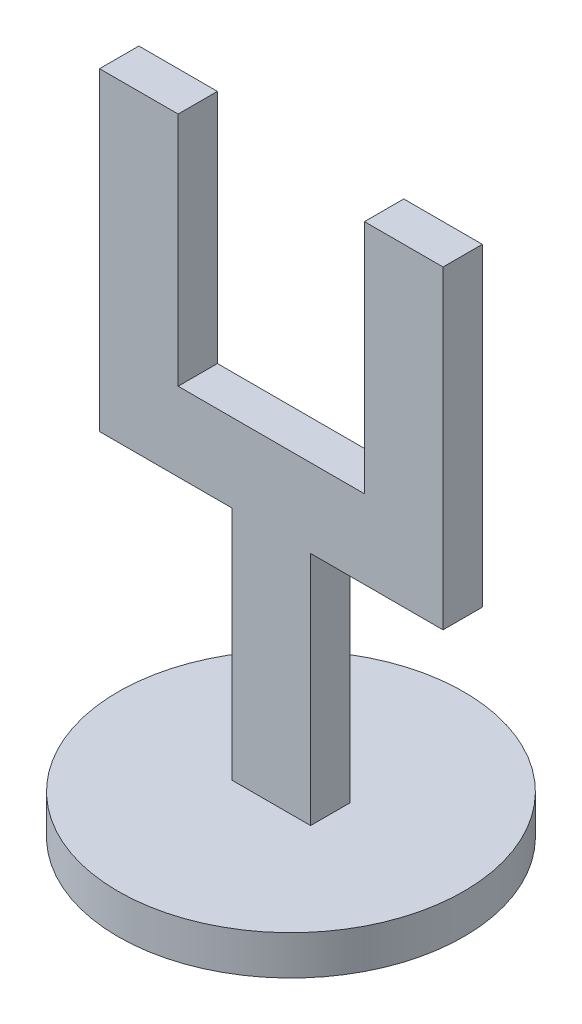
ISO-10303-21;
HEADER;
FILE_DESCRIPTION(('STEP AP214'),'2;1');
FILE_NAME('part.step','',(''),(''),'','','');
FILE_SCHEMA(('AUTOMOTIVE_DESIGN { 1 0 10303 214 1 1 1 1 }'));
ENDSEC;
DATA;
#1=APPLICATION_CONTEXT('core data for automotive mechanical design processes');
#2=APPLICATION_PROTOCOL_DEFINITION('international standard','automotive_design',2000,#1);
#3=PRODUCT_CONTEXT('',#1,'mechanical');
#4=PRODUCT('Part','Part','',(#3));
#5=PRODUCT_RELATED_PRODUCT_CATEGORY('part','',(#4));
#6=PRODUCT_DEFINITION_FORMATION('','',#4);
#7=PRODUCT_DEFINITION_CONTEXT('part definition',#1,'design');
#8=PRODUCT_DEFINITION('design','',#6,#7);
#9=PRODUCT_DEFINITION_SHAPE('','',#8);
#10=(LENGTH_UNIT() NAMED_UNIT(*) SI_UNIT(.MILLI.,.METRE.));
#11=(NAMED_UNIT(*) PLANE_ANGLE_UNIT() SI_UNIT($,.RADIAN.));
#12=(NAMED_UNIT(*) SI_UNIT($,.STERADIAN.) SOLID_ANGLE_UNIT());
#13=UNCERTAINTY_MEASURE_WITH_UNIT(LENGTH_MEASURE(1.E-05),#10,'distance_accuracy_value','');
#14=(GEOMETRIC_REPRESENTATION_CONTEXT(3) GLOBAL_UNCERTAINTY_ASSIGNED_CONTEXT((#13)) GLOBAL_UNIT_ASSIGNED_CONTEXT((#10,
#11,#12)) REPRESENTATION_CONTEXT('',''));
#15=CARTESIAN_POINT('',(0.,0.,0.));
#16=DIRECTION('',(0.,0.,1.));
#17=DIRECTION('',(1.,0.,0.));
#18=AXIS2_PLACEMENT_3D('',#15,#16,#17);
#19=CARTESIAN_POINT('',(0.,5.,0.));
#20=DIRECTION('',(0.,1.,0.));
#21=DIRECTION('',(0.,0.,1.));
#22=AXIS2_PLACEMENT_3D('',#19,#20,#21);
#23=PLANE('',#22);
#24=CARTESIAN_POINT('',(0.,5.,0.));
#25=DIRECTION('',(0.,1.,0.));
#26=DIRECTION('',(0.,0.,1.));
#27=AXIS2_PLACEMENT_3D('',#24,#25,#26);
#28=CIRCLE('',#27,22.);
#29=CARTESIAN_POINT('',(0.,5.,22.));
#30=VERTEX_POINT('',#29);
#31=EDGE_CURVE('E11',#30,#30,#28,.T.);
#32=ORIENTED_EDGE('',*,*,#31,.T.);
#33=EDGE_LOOP('',(#32));
#34=FACE_BOUND('',#33,.T.);
#35=DIRECTION('',(-1.,0.,0.));
#36=VECTOR('',#35,1.);
#37=CARTESIAN_POINT('',(-5.,5.,-2.5));
#38=LINE('',#37,#36);
#39=CARTESIAN_POINT('',(5.,5.,-2.5));
#40=VERTEX_POINT('',#39);
#41=CARTESIAN_POINT('',(-5.,5.,-2.5));
#42=VERTEX_POINT('',#41);
#43=EDGE_CURVE('E246',#40,#42,#38,.T.);
#44=ORIENTED_EDGE('',*,*,#43,.F.);
#45=DIRECTION('',(0.,0.,-1.));
#46=VECTOR('',#45,1.);
#47=CARTESIAN_POINT('',(5.,5.,-2.5));
#48=LINE('',#47,#46);
#49=CARTESIAN_POINT('',(5.,5.,2.5));
#50=VERTEX_POINT('',#49);
#51=EDGE_CURVE('E232',#50,#40,#48,.T.);
#52=ORIENTED_EDGE('',*,*,#51,.F.);
#53=DIRECTION('',(1.,0.,0.));
#54=VECTOR('',#53,1.);
#55=CARTESIAN_POINT('',(-5.,5.,2.5));
#56=LINE('',#55,#54);
#57=CARTESIAN_POINT('',(-5.,5.,2.5));
#58=VERTEX_POINT('',#57);
#59=EDGE_CURVE('E238',#58,#50,#56,.T.);
#60=ORIENTED_EDGE('',*,*,#59,.F.);
#61=DIRECTION('',(0.,0.,1.));
#62=VECTOR('',#61,1.);
#63=CARTESIAN_POINT('',(-5.,5.,-2.5));
#64=LINE('',#63,#62);
#65=EDGE_CURVE('E249',#42,#58,#64,.T.);
#66=ORIENTED_EDGE('',*,*,#65,.F.);
#67=EDGE_LOOP('',(#44,#52,#60,#66));
#68=FACE_BOUND('',#67,.T.);
#69=ADVANCED_FACE('F45',(#34,#68),#23,.T.);
#70=CARTESIAN_POINT('',(0.,5.,0.));
#71=DIRECTION('',(0.,-1.,0.));
#72=DIRECTION('',(0.,0.,-1.));
#73=AXIS2_PLACEMENT_3D('',#70,#71,#72);
#74=CYLINDRICAL_SURFACE('',#73,22.);
#75=ORIENTED_EDGE('',*,*,#31,.F.);
#76=EDGE_LOOP('',(#75));
#77=FACE_BOUND('',#76,.T.);
#78=CARTESIAN_POINT('',(0.,0.,0.));
#79=DIRECTION('',(0.,1.,0.));
#80=DIRECTION('',(0.,0.,1.));
#81=AXIS2_PLACEMENT_3D('',#78,#79,#80);
#82=CIRCLE('',#81,22.);
#83=CARTESIAN_POINT('',(0.,0.,22.));
#84=VERTEX_POINT('',#83);
#85=EDGE_CURVE('E49',#84,#84,#82,.T.);
#86=ORIENTED_EDGE('',*,*,#85,.T.);
#87=EDGE_LOOP('',(#86));
#88=FACE_BOUND('',#87,.T.);
#89=ADVANCED_FACE('F47',(#77,#88),#74,.T.);
#90=CARTESIAN_POINT('',(0.,0.,0.));
#91=DIRECTION('',(0.,1.,0.));
#92=DIRECTION('',(0.,0.,1.));
#93=AXIS2_PLACEMENT_3D('',#90,#91,#92);
#94=PLANE('',#93);
#95=CARTESIAN_POINT('',(0.,0.,0.));
#96=DIRECTION('',(0.,-1.,0.));
#97=DIRECTION('',(0.,0.,-1.));
#98=AXIS2_PLACEMENT_3D('',#95,#96,#97);
#99=CIRCLE('',#98,20.5);
#100=CARTESIAN_POINT('',(0.,0.,-20.5));
#101=VERTEX_POINT('',#100);
#102=EDGE_CURVE('E268',#101,#101,#99,.T.);
#103=ORIENTED_EDGE('',*,*,#102,.F.);
#104=EDGE_LOOP('',(#103));
#105=FACE_BOUND('',#104,.T.);
#106=ORIENTED_EDGE('',*,*,#85,.F.);
#107=EDGE_LOOP('',(#106));
#108=FACE_BOUND('',#107,.T.);
#109=ADVANCED_FACE('F279',(#105,#108),#94,.F.);
#110=CARTESIAN_POINT('',(0.,2.5,0.));
#111=DIRECTION('',(0.,-1.,0.));
#112=DIRECTION('',(0.,0.,-1.));
#113=AXIS2_PLACEMENT_3D('',#110,#111,#112);
#114=CYLINDRICAL_SURFACE('',#113,20.5);
#115=CARTESIAN_POINT('',(0.,2.5,0.));
#116=DIRECTION('',(0.,-1.,0.));
#117=DIRECTION('',(0.,0.,-1.));
#118=AXIS2_PLACEMENT_3D('',#115,#116,#117);
#119=CIRCLE('',#118,20.5);
#120=CARTESIAN_POINT('',(0.,2.5,-20.5));
#121=VERTEX_POINT('',#120);
#122=EDGE_CURVE('E269',#121,#121,#119,.T.);
#123=ORIENTED_EDGE('',*,*,#122,.F.);
#124=EDGE_LOOP('',(#123));
#125=FACE_BOUND('',#124,.T.);
#126=ORIENTED_EDGE('',*,*,#102,.T.);
#127=EDGE_LOOP('',(#126));
#128=FACE_BOUND('',#127,.T.);
#129=ADVANCED_FACE('F277',(#125,#128),#114,.F.);
#130=CARTESIAN_POINT('',(0.,2.5,0.));
#131=DIRECTION('',(0.,-1.,0.));
#132=DIRECTION('',(0.,0.,-1.));
#133=AXIS2_PLACEMENT_3D('',#130,#131,#132);
#134=PLANE('',#133);
#135=ORIENTED_EDGE('',*,*,#122,.T.);
#136=EDGE_LOOP('',(#135));
#137=FACE_BOUND('',#136,.T.);
#138=ADVANCED_FACE('F317',(#137),#134,.T.);
#139=CARTESIAN_POINT('',(5.,35.,-2.5));
#140=DIRECTION('',(-1.,0.,0.));
#141=DIRECTION('',(0.,0.,1.));
#142=AXIS2_PLACEMENT_3D('',#139,#140,#141);
#143=PLANE('',#142);
#144=ORIENTED_EDGE('',*,*,#51,.T.);
#145=DIRECTION('',(0.,-1.,0.));
#146=VECTOR('',#145,1.);
#147=CARTESIAN_POINT('',(5.,35.,-2.5));
#148=LINE('',#147,#146);
#149=CARTESIAN_POINT('',(5.,35.,-2.5));
#150=VERTEX_POINT('',#149);
#151=EDGE_CURVE('E265',#150,#40,#148,.T.);
#152=ORIENTED_EDGE('',*,*,#151,.F.);
#153=DIRECTION('',(0.,0.,-1.));
#154=VECTOR('',#153,1.);
#155=CARTESIAN_POINT('',(5.,35.,-2.5));
#156=LINE('',#155,#154);
#157=CARTESIAN_POINT('',(5.,35.,2.5));
#158=VERTEX_POINT('',#157);
#159=EDGE_CURVE('E233',#158,#150,#156,.T.);
#160=ORIENTED_EDGE('',*,*,#159,.F.);
#161=DIRECTION('',(0.,-1.,0.));
#162=VECTOR('',#161,1.);
#163=CARTESIAN_POINT('',(5.,35.,2.5));
#164=LINE('',#163,#162);
#165=EDGE_CURVE('E242',#158,#50,#164,.T.);
#166=ORIENTED_EDGE('',*,*,#165,.T.);
#167=EDGE_LOOP('',(#144,#152,#160,#166));
#168=FACE_BOUND('',#167,.T.);
#169=ADVANCED_FACE('F315',(#168),#143,.F.);
#170=CARTESIAN_POINT('',(-5.,35.,-2.5));
#171=DIRECTION('',(0.,0.,1.));
#172=DIRECTION('',(1.,0.,0.));
#173=AXIS2_PLACEMENT_3D('',#170,#171,#172);
#174=PLANE('',#173);
#175=ORIENTED_EDGE('',*,*,#43,.T.);
#176=DIRECTION('',(0.,-1.,0.));
#177=VECTOR('',#176,1.);
#178=CARTESIAN_POINT('',(-5.,35.,-2.5));
#179=LINE('',#178,#177);
#180=CARTESIAN_POINT('',(-5.,35.,-2.5));
#181=VERTEX_POINT('',#180);
#182=EDGE_CURVE('E261',#181,#42,#179,.T.);
#183=ORIENTED_EDGE('',*,*,#182,.F.);
#184=DIRECTION('',(-1.,0.,0.));
#185=VECTOR('',#184,1.);
#186=CARTESIAN_POINT('',(21.8574929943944,35.,-2.5));
#187=LINE('',#186,#185);
#188=CARTESIAN_POINT('',(-21.8574929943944,35.,-2.5));
#189=VERTEX_POINT('',#188);
#190=EDGE_CURVE('E220',#181,#189,#187,.T.);
#191=ORIENTED_EDGE('',*,*,#190,.T.);
#192=DIRECTION('',(0.,-1.,0.));
#193=VECTOR('',#192,1.);
#194=CARTESIAN_POINT('',(-21.8574929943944,45.,-2.5));
#195=LINE('',#194,#193);
#196=CARTESIAN_POINT('',(-21.8574929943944,75.,-2.5));
#197=VERTEX_POINT('',#196);
#198=EDGE_CURVE('E147',#197,#189,#195,.T.);
#199=ORIENTED_EDGE('',*,*,#198,.F.);
#200=DIRECTION('',(-1.,0.,0.));
#201=VECTOR('',#200,1.);
#202=CARTESIAN_POINT('',(-21.8574929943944,75.,-2.5));
#203=LINE('',#202,#201);
#204=CARTESIAN_POINT('',(-11.8574929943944,75.,-2.49999999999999));
#205=VERTEX_POINT('',#204);
#206=EDGE_CURVE('E187',#205,#197,#203,.T.);
#207=ORIENTED_EDGE('',*,*,#206,.F.);
#208=DIRECTION('',(0.,-1.,0.));
#209=VECTOR('',#208,1.);
#210=CARTESIAN_POINT('',(-11.8574929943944,75.,-2.49999999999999));
#211=LINE('',#210,#209);
#212=CARTESIAN_POINT('',(-11.8574929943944,45.,-2.49999999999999));
#213=VERTEX_POINT('',#212);
#214=EDGE_CURVE('E183',#205,#213,#211,.T.);
#215=ORIENTED_EDGE('',*,*,#214,.T.);
#216=DIRECTION('',(-1.,0.,0.));
#217=VECTOR('',#216,1.);
#218=CARTESIAN_POINT('',(21.8574929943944,45.,-2.5));
#219=LINE('',#218,#217);
#220=CARTESIAN_POINT('',(11.8574929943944,45.,-2.5));
#221=VERTEX_POINT('',#220);
#222=EDGE_CURVE('E206',#221,#213,#219,.T.);
#223=ORIENTED_EDGE('',*,*,#222,.F.);
#224=DIRECTION('',(0.,-1.,0.));
#225=VECTOR('',#224,1.);
#226=CARTESIAN_POINT('',(11.8574929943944,75.,-2.5));
#227=LINE('',#226,#225);
#228=CARTESIAN_POINT('',(11.8574929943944,75.,-2.5));
#229=VERTEX_POINT('',#228);
#230=EDGE_CURVE('E153',#229,#221,#227,.T.);
#231=ORIENTED_EDGE('',*,*,#230,.F.);
#232=DIRECTION('',(-1.,0.,0.));
#233=VECTOR('',#232,1.);
#234=CARTESIAN_POINT('',(21.8574929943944,75.,-2.5));
#235=LINE('',#234,#233);
#236=CARTESIAN_POINT('',(21.8574929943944,75.,-2.5));
#237=VERTEX_POINT('',#236);
#238=EDGE_CURVE('E150',#237,#229,#235,.T.);
#239=ORIENTED_EDGE('',*,*,#238,.F.);
#240=DIRECTION('',(0.,-1.,0.));
#241=VECTOR('',#240,1.);
#242=CARTESIAN_POINT('',(21.8574929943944,45.,-2.5));
#243=LINE('',#242,#241);
#244=CARTESIAN_POINT('',(21.8574929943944,35.,-2.5));
#245=VERTEX_POINT('',#244);
#246=EDGE_CURVE('E134',#237,#245,#243,.T.);
#247=ORIENTED_EDGE('',*,*,#246,.T.);
#248=EDGE_CURVE('E207',#245,#150,#187,.T.);
#249=ORIENTED_EDGE('',*,*,#248,.T.);
#250=ORIENTED_EDGE('',*,*,#151,.T.);
#251=EDGE_LOOP('',(#175,#183,#191,#199,#207,#215,#223,#231,#239,#247,#249,#250));
#252=FACE_BOUND('',#251,.T.);
#253=ADVANCED_FACE('F151',(#252),#174,.F.);
#254=CARTESIAN_POINT('',(-5.,35.,-2.5));
#255=DIRECTION('',(1.,0.,0.));
#256=DIRECTION('',(0.,0.,-1.));
#257=AXIS2_PLACEMENT_3D('',#254,#255,#256);
#258=PLANE('',#257);
#259=ORIENTED_EDGE('',*,*,#65,.T.);
#260=DIRECTION('',(0.,-1.,0.));
#261=VECTOR('',#260,1.);
#262=CARTESIAN_POINT('',(-5.,35.,2.5));
#263=LINE('',#262,#261);
#264=CARTESIAN_POINT('',(-5.,35.,2.5));
#265=VERTEX_POINT('',#264);
#266=EDGE_CURVE('E258',#265,#58,#263,.T.);
#267=ORIENTED_EDGE('',*,*,#266,.F.);
#268=DIRECTION('',(0.,0.,1.));
#269=VECTOR('',#268,1.);
#270=CARTESIAN_POINT('',(-5.,35.,-2.5));
#271=LINE('',#270,#269);
#272=EDGE_CURVE('E237',#181,#265,#271,.T.);
#273=ORIENTED_EDGE('',*,*,#272,.F.);
#274=ORIENTED_EDGE('',*,*,#182,.T.);
#275=EDGE_LOOP('',(#259,#267,#273,#274));
#276=FACE_BOUND('',#275,.T.);
#277=ADVANCED_FACE('F301',(#276),#258,.F.);
#278=CARTESIAN_POINT('',(-5.,35.,2.5));
#279=DIRECTION('',(0.,0.,-1.));
#280=DIRECTION('',(-1.,0.,0.));
#281=AXIS2_PLACEMENT_3D('',#278,#279,#280);
#282=PLANE('',#281);
#283=ORIENTED_EDGE('',*,*,#59,.T.);
#284=ORIENTED_EDGE('',*,*,#165,.F.);
#285=DIRECTION('',(1.,0.,0.));
#286=VECTOR('',#285,1.);
#287=CARTESIAN_POINT('',(21.8574929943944,35.,2.5));
#288=LINE('',#287,#286);
#289=CARTESIAN_POINT('',(21.8574929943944,35.,2.5));
#290=VERTEX_POINT('',#289);
#291=EDGE_CURVE('E213',#158,#290,#288,.T.);
#292=ORIENTED_EDGE('',*,*,#291,.T.);
#293=DIRECTION('',(0.,-1.,0.));
#294=VECTOR('',#293,1.);
#295=CARTESIAN_POINT('',(21.8574929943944,45.,2.5));
#296=LINE('',#295,#294);
#297=CARTESIAN_POINT('',(21.8574929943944,75.,2.5));
#298=VERTEX_POINT('',#297);
#299=EDGE_CURVE('E146',#298,#290,#296,.T.);
#300=ORIENTED_EDGE('',*,*,#299,.F.);
#301=DIRECTION('',(1.,0.,0.));
#302=VECTOR('',#301,1.);
#303=CARTESIAN_POINT('',(21.8574929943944,75.,2.5));
#304=LINE('',#303,#302);
#305=CARTESIAN_POINT('',(11.8574929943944,75.,2.5));
#306=VERTEX_POINT('',#305);
#307=EDGE_CURVE('E162',#306,#298,#304,.T.);
#308=ORIENTED_EDGE('',*,*,#307,.F.);
#309=DIRECTION('',(0.,-1.,0.));
#310=VECTOR('',#309,1.);
#311=CARTESIAN_POINT('',(11.8574929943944,75.,2.5));
#312=LINE('',#311,#310);
#313=CARTESIAN_POINT('',(11.8574929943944,45.,2.5));
#314=VERTEX_POINT('',#313);
#315=EDGE_CURVE('E171',#306,#314,#312,.T.);
#316=ORIENTED_EDGE('',*,*,#315,.T.);
#317=DIRECTION('',(1.,0.,0.));
#318=VECTOR('',#317,1.);
#319=CARTESIAN_POINT('',(21.8574929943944,45.,2.5));
#320=LINE('',#319,#318);
#321=CARTESIAN_POINT('',(-11.8574929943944,45.,2.5));
#322=VERTEX_POINT('',#321);
#323=EDGE_CURVE('E203',#322,#314,#320,.T.);
#324=ORIENTED_EDGE('',*,*,#323,.F.);
#325=DIRECTION('',(0.,-1.,0.));
#326=VECTOR('',#325,1.);
#327=CARTESIAN_POINT('',(-11.8574929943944,75.,2.5));
#328=LINE('',#327,#326);
#329=CARTESIAN_POINT('',(-11.8574929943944,75.,2.5));
#330=VERTEX_POINT('',#329);
#331=EDGE_CURVE('E179',#330,#322,#328,.T.);
#332=ORIENTED_EDGE('',*,*,#331,.F.);
#333=DIRECTION('',(1.,0.,0.));
#334=VECTOR('',#333,1.);
#335=CARTESIAN_POINT('',(-21.8574929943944,75.,2.5));
#336=LINE('',#335,#334);
#337=CARTESIAN_POINT('',(-21.8574929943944,75.,2.5));
#338=VERTEX_POINT('',#337);
#339=EDGE_CURVE('E197',#338,#330,#336,.T.);
#340=ORIENTED_EDGE('',*,*,#339,.F.);
#341=DIRECTION('',(0.,-1.,0.));
#342=VECTOR('',#341,1.);
#343=CARTESIAN_POINT('',(-21.8574929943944,45.,2.5));
#344=LINE('',#343,#342);
#345=CARTESIAN_POINT('',(-21.8574929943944,35.,2.5));
#346=VERTEX_POINT('',#345);
#347=EDGE_CURVE('E228',#338,#346,#344,.T.);
#348=ORIENTED_EDGE('',*,*,#347,.T.);
#349=EDGE_CURVE('E214',#346,#265,#288,.T.);
#350=ORIENTED_EDGE('',*,*,#349,.T.);
#351=ORIENTED_EDGE('',*,*,#266,.T.);
#352=EDGE_LOOP('',(#283,#284,#292,#300,#308,#316,#324,#332,#340,#348,#350,#351));
#353=FACE_BOUND('',#352,.T.);
#354=ADVANCED_FACE('F310',(#353),#282,.F.);
#355=CARTESIAN_POINT('',(0.,35.,0.));
#356=DIRECTION('',(0.,1.,0.));
#357=DIRECTION('',(0.,0.,1.));
#358=AXIS2_PLACEMENT_3D('',#355,#356,#357);
#359=PLANE('',#358);
#360=ORIENTED_EDGE('',*,*,#291,.F.);
#361=ORIENTED_EDGE('',*,*,#159,.T.);
#362=ORIENTED_EDGE('',*,*,#248,.F.);
#363=DIRECTION('',(0.,0.,-1.));
#364=VECTOR('',#363,1.);
#365=CARTESIAN_POINT('',(21.8574929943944,35.,2.5));
#366=LINE('',#365,#364);
#367=EDGE_CURVE('E141',#290,#245,#366,.T.);
#368=ORIENTED_EDGE('',*,*,#367,.F.);
#369=EDGE_LOOP('',(#360,#361,#362,#368));
#370=FACE_BOUND('',#369,.T.);
#371=ADVANCED_FACE('F313',(#370),#359,.F.);
#372=ORIENTED_EDGE('',*,*,#190,.F.);
#373=ORIENTED_EDGE('',*,*,#272,.T.);
#374=ORIENTED_EDGE('',*,*,#349,.F.);
#375=DIRECTION('',(0.,0.,1.));
#376=VECTOR('',#375,1.);
#377=CARTESIAN_POINT('',(-21.8574929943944,35.,2.5));
#378=LINE('',#377,#376);
#379=EDGE_CURVE('E178',#189,#346,#378,.T.);
#380=ORIENTED_EDGE('',*,*,#379,.F.);
#381=EDGE_LOOP('',(#372,#373,#374,#380));
#382=FACE_BOUND('',#381,.T.);
#383=ADVANCED_FACE('F305',(#382),#359,.F.);
#384=CARTESIAN_POINT('',(-21.8574929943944,45.,2.5));
#385=DIRECTION('',(1.,0.,0.));
#386=DIRECTION('',(0.,0.,-1.));
#387=AXIS2_PLACEMENT_3D('',#384,#385,#386);
#388=PLANE('',#387);
#389=ORIENTED_EDGE('',*,*,#379,.T.);
#390=ORIENTED_EDGE('',*,*,#347,.F.);
#391=DIRECTION('',(0.,0.,1.));
#392=VECTOR('',#391,1.);
#393=CARTESIAN_POINT('',(-21.8574929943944,75.,-2.5));
#394=LINE('',#393,#392);
#395=EDGE_CURVE('E190',#197,#338,#394,.T.);
#396=ORIENTED_EDGE('',*,*,#395,.F.);
#397=ORIENTED_EDGE('',*,*,#198,.T.);
#398=EDGE_LOOP('',(#389,#390,#396,#397));
#399=FACE_BOUND('',#398,.T.);
#400=ADVANCED_FACE('F386',(#399),#388,.F.);
#401=CARTESIAN_POINT('',(21.8574929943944,45.,2.5));
#402=DIRECTION('',(-1.,0.,0.));
#403=DIRECTION('',(0.,0.,1.));
#404=AXIS2_PLACEMENT_3D('',#401,#402,#403);
#405=PLANE('',#404);
#406=ORIENTED_EDGE('',*,*,#367,.T.);
#407=ORIENTED_EDGE('',*,*,#246,.F.);
#408=DIRECTION('',(0.,0.,-1.));
#409=VECTOR('',#408,1.);
#410=CARTESIAN_POINT('',(21.8574929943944,75.,-2.5));
#411=LINE('',#410,#409);
#412=EDGE_CURVE('E139',#298,#237,#411,.T.);
#413=ORIENTED_EDGE('',*,*,#412,.F.);
#414=ORIENTED_EDGE('',*,*,#299,.T.);
#415=EDGE_LOOP('',(#406,#407,#413,#414));
#416=FACE_BOUND('',#415,.T.);
#417=ADVANCED_FACE('F136',(#416),#405,.F.);
#418=CARTESIAN_POINT('',(0.,45.,0.));
#419=DIRECTION('',(0.,1.,0.));
#420=DIRECTION('',(0.,0.,1.));
#421=AXIS2_PLACEMENT_3D('',#418,#419,#420);
#422=PLANE('',#421);
#423=DIRECTION('',(0.,0.,1.));
#424=VECTOR('',#423,1.);
#425=CARTESIAN_POINT('',(11.8574929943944,45.,-2.5));
#426=LINE('',#425,#424);
#427=EDGE_CURVE('E61',#221,#314,#426,.T.);
#428=ORIENTED_EDGE('',*,*,#427,.F.);
#429=ORIENTED_EDGE('',*,*,#222,.T.);
#430=DIRECTION('',(0.,0.,-1.));
#431=VECTOR('',#430,1.);
#432=CARTESIAN_POINT('',(-11.8574929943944,45.,-2.49999999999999));
#433=LINE('',#432,#431);
#434=EDGE_CURVE('E66',#322,#213,#433,.T.);
#435=ORIENTED_EDGE('',*,*,#434,.F.);
#436=ORIENTED_EDGE('',*,*,#323,.T.);
#437=EDGE_LOOP('',(#428,#429,#435,#436));
#438=FACE_BOUND('',#437,.T.);
#439=ADVANCED_FACE('F402',(#438),#422,.T.);
#440=CARTESIAN_POINT('',(-11.8574929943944,75.,-2.49999999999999));
#441=DIRECTION('',(-1.,0.,0.));
#442=DIRECTION('',(0.,0.,1.));
#443=AXIS2_PLACEMENT_3D('',#440,#441,#442);
#444=PLANE('',#443);
#445=ORIENTED_EDGE('',*,*,#434,.T.);
#446=ORIENTED_EDGE('',*,*,#214,.F.);
#447=DIRECTION('',(0.,0.,-1.));
#448=VECTOR('',#447,1.);
#449=CARTESIAN_POINT('',(-11.8574929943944,75.,-2.49999999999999));
#450=LINE('',#449,#448);
#451=EDGE_CURVE('E194',#330,#205,#450,.T.);
#452=ORIENTED_EDGE('',*,*,#451,.F.);
#453=ORIENTED_EDGE('',*,*,#331,.T.);
#454=EDGE_LOOP('',(#445,#446,#452,#453));
#455=FACE_BOUND('',#454,.T.);
#456=ADVANCED_FACE('F411',(#455),#444,.F.);
#457=CARTESIAN_POINT('',(0.,75.,0.));
#458=DIRECTION('',(0.,1.,0.));
#459=DIRECTION('',(0.,0.,1.));
#460=AXIS2_PLACEMENT_3D('',#457,#458,#459);
#461=PLANE('',#460);
#462=ORIENTED_EDGE('',*,*,#395,.T.);
#463=ORIENTED_EDGE('',*,*,#339,.T.);
#464=ORIENTED_EDGE('',*,*,#451,.T.);
#465=ORIENTED_EDGE('',*,*,#206,.T.);
#466=EDGE_LOOP('',(#462,#463,#464,#465));
#467=FACE_BOUND('',#466,.T.);
#468=ADVANCED_FACE('F420',(#467),#461,.T.);
#469=CARTESIAN_POINT('',(11.8574929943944,75.,-2.5));
#470=DIRECTION('',(1.,0.,0.));
#471=DIRECTION('',(0.,0.,-1.));
#472=AXIS2_PLACEMENT_3D('',#469,#470,#471);
#473=PLANE('',#472);
#474=ORIENTED_EDGE('',*,*,#427,.T.);
#475=ORIENTED_EDGE('',*,*,#315,.F.);
#476=DIRECTION('',(0.,0.,1.));
#477=VECTOR('',#476,1.);
#478=CARTESIAN_POINT('',(11.8574929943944,75.,-2.5));
#479=LINE('',#478,#477);
#480=EDGE_CURVE('E157',#229,#306,#479,.T.);
#481=ORIENTED_EDGE('',*,*,#480,.F.);
#482=ORIENTED_EDGE('',*,*,#230,.T.);
#483=EDGE_LOOP('',(#474,#475,#481,#482));
#484=FACE_BOUND('',#483,.T.);
#485=ADVANCED_FACE('F429',(#484),#473,.F.);
#486=CARTESIAN_POINT('',(0.,75.,0.));
#487=DIRECTION('',(0.,-1.,0.));
#488=DIRECTION('',(0.,0.,-1.));
#489=AXIS2_PLACEMENT_3D('',#486,#487,#488);
#490=PLANE('',#489);
#491=ORIENTED_EDGE('',*,*,#412,.T.);
#492=ORIENTED_EDGE('',*,*,#238,.T.);
#493=ORIENTED_EDGE('',*,*,#480,.T.);
#494=ORIENTED_EDGE('',*,*,#307,.T.);
#495=EDGE_LOOP('',(#491,#492,#493,#494));
#496=FACE_BOUND('',#495,.T.);
#497=ADVANCED_FACE('F160',(#496),#490,.F.);
#498=CLOSED_SHELL('',(#69,#89,#109,#129,#138,#169,#253,#277,#354,#371,#383,#400,#417,#439,#456,
#468,#485,#497));
#499=MANIFOLD_SOLID_BREP('B2',#498);
#500=ADVANCED_BREP_SHAPE_REPRESENTATION('',(#18,#499),#14);
#501=SHAPE_DEFINITION_REPRESENTATION(#9,#500);
ENDSEC;
END-ISO-10303-21;
